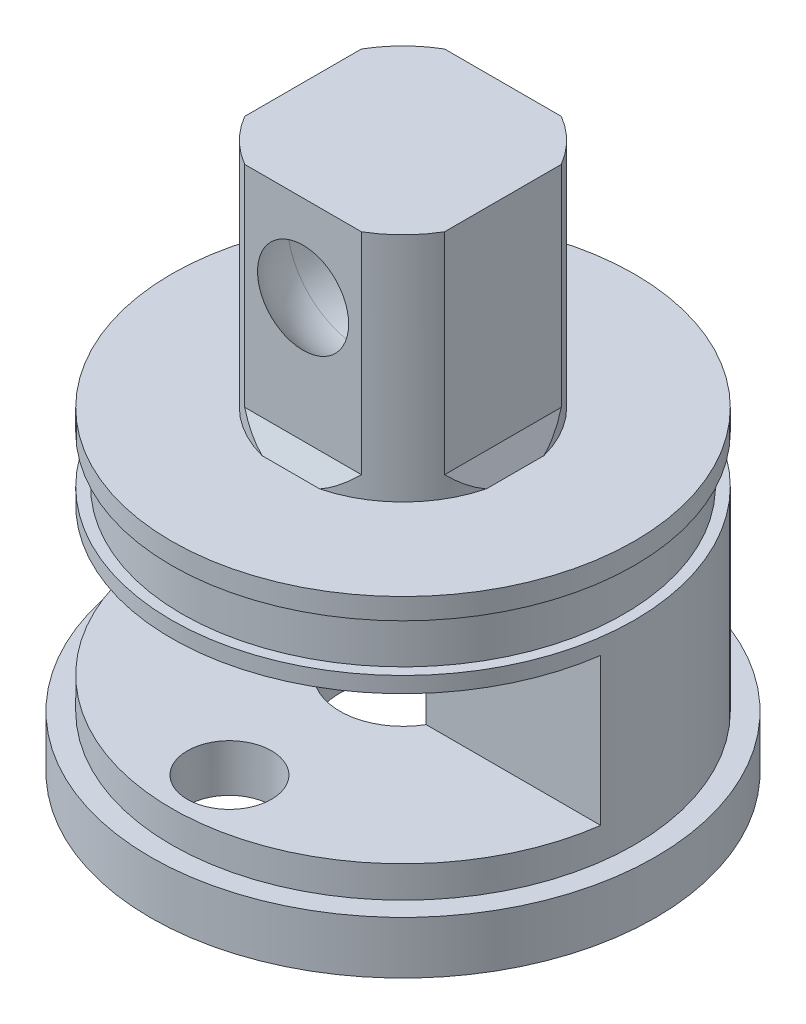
ISO-10303-21;
HEADER;
FILE_DESCRIPTION(('STEP AP214'),'2;1');
FILE_NAME('part.step','',(''),(''),'','','');
FILE_SCHEMA(('AUTOMOTIVE_DESIGN { 1 0 10303 214 1 1 1 1 }'));
ENDSEC;
DATA;
#1=APPLICATION_CONTEXT('core data for automotive mechanical design processes');
#2=APPLICATION_PROTOCOL_DEFINITION('international standard','automotive_design',2000,#1);
#3=PRODUCT_CONTEXT('',#1,'mechanical');
#4=PRODUCT('Part','Part','',(#3));
#5=PRODUCT_RELATED_PRODUCT_CATEGORY('part','',(#4));
#6=PRODUCT_DEFINITION_FORMATION('','',#4);
#7=PRODUCT_DEFINITION_CONTEXT('part definition',#1,'design');
#8=PRODUCT_DEFINITION('design','',#6,#7);
#9=PRODUCT_DEFINITION_SHAPE('','',#8);
#10=(LENGTH_UNIT() NAMED_UNIT(*) SI_UNIT(.MILLI.,.METRE.));
#11=(NAMED_UNIT(*) PLANE_ANGLE_UNIT() SI_UNIT($,.RADIAN.));
#12=(NAMED_UNIT(*) SI_UNIT($,.STERADIAN.) SOLID_ANGLE_UNIT());
#13=UNCERTAINTY_MEASURE_WITH_UNIT(LENGTH_MEASURE(1.E-05),#10,'distance_accuracy_value','');
#14=(GEOMETRIC_REPRESENTATION_CONTEXT(3) GLOBAL_UNCERTAINTY_ASSIGNED_CONTEXT((#13)) GLOBAL_UNIT_ASSIGNED_CONTEXT((#10,
#11,#12)) REPRESENTATION_CONTEXT('',''));
#15=CARTESIAN_POINT('',(0.,0.,0.));
#16=DIRECTION('',(0.,0.,1.));
#17=DIRECTION('',(1.,0.,0.));
#18=AXIS2_PLACEMENT_3D('',#15,#16,#17);
#19=CARTESIAN_POINT('',(4.75000000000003,14.25,4.75000000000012));
#20=DIRECTION('',(0.,0.,1.));
#21=DIRECTION('',(1.,0.,0.));
#22=AXIS2_PLACEMENT_3D('',#19,#20,#21);
#23=PLANE('',#22);
#24=DIRECTION('',(1.,0.,0.));
#25=VECTOR('',#24,1.);
#26=CARTESIAN_POINT('',(4.75000000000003,14.25,4.75000000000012));
#27=LINE('',#26,#25);
#28=CARTESIAN_POINT('',(-2.77263412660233,14.25,4.75000000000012));
#29=VERTEX_POINT('',#28);
#30=CARTESIAN_POINT('',(2.77263412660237,14.25,4.75000000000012));
#31=VERTEX_POINT('',#30);
#32=EDGE_CURVE('E296',#29,#31,#27,.T.);
#33=ORIENTED_EDGE('',*,*,#32,.T.);
#34=DIRECTION('',(0.,-1.,0.));
#35=VECTOR('',#34,1.);
#36=CARTESIAN_POINT('',(2.77263412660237,0.,4.75000000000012));
#37=LINE('',#36,#35);
#38=CARTESIAN_POINT('',(2.77263412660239,24.25,4.75000000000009));
#39=VERTEX_POINT('',#38);
#40=EDGE_CURVE('E273',#39,#31,#37,.T.);
#41=ORIENTED_EDGE('',*,*,#40,.F.);
#42=DIRECTION('',(1.,0.,0.));
#43=VECTOR('',#42,1.);
#44=CARTESIAN_POINT('',(5.5,24.25,4.75000000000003));
#45=LINE('',#44,#43);
#46=CARTESIAN_POINT('',(-2.77263412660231,24.25,4.75000000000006));
#47=VERTEX_POINT('',#46);
#48=EDGE_CURVE('E33',#47,#39,#45,.T.);
#49=ORIENTED_EDGE('',*,*,#48,.F.);
#50=DIRECTION('',(0.,-1.,0.));
#51=VECTOR('',#50,1.);
#52=CARTESIAN_POINT('',(-2.77263412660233,0.,4.75000000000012));
#53=LINE('',#52,#51);
#54=EDGE_CURVE('E171',#29,#47,#53,.F.);
#55=ORIENTED_EDGE('',*,*,#54,.F.);
#56=EDGE_LOOP('',(#33,#41,#49,#55));
#57=FACE_BOUND('',#56,.T.);
#58=CARTESIAN_POINT('',(0.,20.1474236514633,4.75));
#59=DIRECTION('',(0.,0.,1.));
#60=DIRECTION('',(1.,0.,0.));
#61=AXIS2_PLACEMENT_3D('',#58,#59,#60);
#62=CIRCLE('',#61,2.1650635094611);
#63=CARTESIAN_POINT('',(2.16506350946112,20.1474236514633,4.75));
#64=VERTEX_POINT('',#63);
#65=EDGE_CURVE('E330',#64,#64,#62,.F.);
#66=ORIENTED_EDGE('',*,*,#65,.T.);
#67=EDGE_LOOP('',(#66));
#68=FACE_BOUND('',#67,.T.);
#69=ADVANCED_FACE('F24',(#57,#68),#23,.T.);
#70=CARTESIAN_POINT('',(0.,0.,0.));
#71=DIRECTION('',(0.,-1.,0.));
#72=DIRECTION('',(0.,0.,-1.));
#73=AXIS2_PLACEMENT_3D('',#70,#71,#72);
#74=CYLINDRICAL_SURFACE('',#73,5.5);
#75=CARTESIAN_POINT('',(0.,13.25,1.11022302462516E-13));
#76=DIRECTION('',(0.,-1.,0.));
#77=DIRECTION('',(0.,0.,-1.));
#78=AXIS2_PLACEMENT_3D('',#75,#76,#77);
#79=CIRCLE('',#78,5.5);
#80=CARTESIAN_POINT('',(5.32735026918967,13.25,1.36723776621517));
#81=VERTEX_POINT('',#80);
#82=CARTESIAN_POINT('',(1.36723776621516,13.25,5.32735026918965));
#83=VERTEX_POINT('',#82);
#84=EDGE_CURVE('E161',#81,#83,#79,.T.);
#85=ORIENTED_EDGE('',*,*,#84,.F.);
#86=CARTESIAN_POINT('',(0.,22.4772413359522,0.));
#87=DIRECTION('',(-0.866025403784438,-0.500000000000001,0.));
#88=DIRECTION('',(0.500000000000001,-0.866025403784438,0.));
#89=AXIS2_PLACEMENT_3D('',#86,#87,#88);
#90=ELLIPSE('',#89,11.,5.5);
#91=CARTESIAN_POINT('',(4.75000000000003,14.25,2.77263412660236));
#92=VERTEX_POINT('',#91);
#93=EDGE_CURVE('E142',#81,#92,#90,.T.);
#94=ORIENTED_EDGE('',*,*,#93,.T.);
#95=DIRECTION('',(0.,-1.,0.));
#96=VECTOR('',#95,1.);
#97=CARTESIAN_POINT('',(4.75000000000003,0.,2.77263412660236));
#98=LINE('',#97,#96);
#99=CARTESIAN_POINT('',(4.75,24.25,2.77263412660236));
#100=VERTEX_POINT('',#99);
#101=EDGE_CURVE('E157',#92,#100,#98,.F.);
#102=ORIENTED_EDGE('',*,*,#101,.T.);
#103=CARTESIAN_POINT('',(0.,24.25,0.));
#104=DIRECTION('',(0.,-1.,0.));
#105=DIRECTION('',(0.,0.,-1.));
#106=AXIS2_PLACEMENT_3D('',#103,#104,#105);
#107=CIRCLE('',#106,5.5);
#108=EDGE_CURVE('E214',#100,#39,#107,.T.);
#109=ORIENTED_EDGE('',*,*,#108,.T.);
#110=ORIENTED_EDGE('',*,*,#40,.T.);
#111=CARTESIAN_POINT('',(0.,22.4772413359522,0.));
#112=DIRECTION('',(0.,-0.500000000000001,-0.866025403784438));
#113=DIRECTION('',(0.,-0.866025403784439,0.500000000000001));
#114=AXIS2_PLACEMENT_3D('',#111,#112,#113);
#115=ELLIPSE('',#114,11.,5.5);
#116=EDGE_CURVE('E162',#31,#83,#115,.T.);
#117=ORIENTED_EDGE('',*,*,#116,.T.);
#118=EDGE_LOOP('',(#85,#94,#102,#109,#110,#117));
#119=FACE_BOUND('',#118,.T.);
#120=ADVANCED_FACE('F155',(#119),#74,.T.);
#121=DIRECTION('',(0.,-1.,0.));
#122=VECTOR('',#121,1.);
#123=CARTESIAN_POINT('',(4.75000000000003,0.,-2.77263412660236));
#124=LINE('',#123,#122);
#125=CARTESIAN_POINT('',(4.75000000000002,24.25,-2.77263412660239));
#126=VERTEX_POINT('',#125);
#127=CARTESIAN_POINT('',(4.75000000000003,14.25,-2.77263412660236));
#128=VERTEX_POINT('',#127);
#129=EDGE_CURVE('E166',#126,#128,#124,.T.);
#130=ORIENTED_EDGE('',*,*,#129,.T.);
#131=CARTESIAN_POINT('',(5.32735026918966,13.25,-1.36723776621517));
#132=VERTEX_POINT('',#131);
#133=EDGE_CURVE('E145',#128,#132,#90,.T.);
#134=ORIENTED_EDGE('',*,*,#133,.T.);
#135=CARTESIAN_POINT('',(1.3672377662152,13.25,-5.32735026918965));
#136=VERTEX_POINT('',#135);
#137=EDGE_CURVE('E215',#136,#132,#79,.T.);
#138=ORIENTED_EDGE('',*,*,#137,.F.);
#139=CARTESIAN_POINT('',(0.,22.4772413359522,0.));
#140=DIRECTION('',(0.,-0.500000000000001,0.866025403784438));
#141=DIRECTION('',(0.,-0.866025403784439,-0.500000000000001));
#142=AXIS2_PLACEMENT_3D('',#139,#140,#141);
#143=ELLIPSE('',#142,11.,5.5);
#144=CARTESIAN_POINT('',(2.77263412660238,14.25,-4.74999999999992));
#145=VERTEX_POINT('',#144);
#146=EDGE_CURVE('E150',#136,#145,#143,.T.);
#147=ORIENTED_EDGE('',*,*,#146,.T.);
#148=DIRECTION('',(0.,-1.,0.));
#149=VECTOR('',#148,1.);
#150=CARTESIAN_POINT('',(2.77263412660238,0.,-4.75));
#151=LINE('',#150,#149);
#152=CARTESIAN_POINT('',(2.77263412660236,24.25,-4.75));
#153=VERTEX_POINT('',#152);
#154=EDGE_CURVE('E289',#145,#153,#151,.F.);
#155=ORIENTED_EDGE('',*,*,#154,.T.);
#156=EDGE_CURVE('E210',#153,#126,#107,.T.);
#157=ORIENTED_EDGE('',*,*,#156,.T.);
#158=EDGE_LOOP('',(#130,#134,#138,#147,#155,#157));
#159=FACE_BOUND('',#158,.T.);
#160=ADVANCED_FACE('F292',(#159),#74,.T.);
#161=CARTESIAN_POINT('',(-1.36723776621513,13.25,5.32735026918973));
#162=VERTEX_POINT('',#161);
#163=CARTESIAN_POINT('',(-5.32735026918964,13.25,1.36723776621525));
#164=VERTEX_POINT('',#163);
#165=EDGE_CURVE('E652',#162,#164,#79,.T.);
#166=ORIENTED_EDGE('',*,*,#165,.F.);
#167=EDGE_CURVE('E304',#162,#29,#115,.T.);
#168=ORIENTED_EDGE('',*,*,#167,.T.);
#169=ORIENTED_EDGE('',*,*,#54,.T.);
#170=CARTESIAN_POINT('',(-4.74999999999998,24.25,2.77263412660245));
#171=VERTEX_POINT('',#170);
#172=EDGE_CURVE('E268',#47,#171,#107,.T.);
#173=ORIENTED_EDGE('',*,*,#172,.T.);
#174=DIRECTION('',(0.,-1.,0.));
#175=VECTOR('',#174,1.);
#176=CARTESIAN_POINT('',(-4.74999999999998,0.,2.77263412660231));
#177=LINE('',#176,#175);
#178=CARTESIAN_POINT('',(-4.74999999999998,14.25,2.77263412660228));
#179=VERTEX_POINT('',#178);
#180=EDGE_CURVE('E48',#171,#179,#177,.T.);
#181=ORIENTED_EDGE('',*,*,#180,.T.);
#182=CARTESIAN_POINT('',(0.,22.4772413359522,0.));
#183=DIRECTION('',(0.866025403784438,-0.500000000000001,0.));
#184=DIRECTION('',(-0.500000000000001,-0.866025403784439,0.));
#185=AXIS2_PLACEMENT_3D('',#182,#183,#184);
#186=ELLIPSE('',#185,11.,5.5);
#187=EDGE_CURVE('E315',#179,#164,#186,.T.);
#188=ORIENTED_EDGE('',*,*,#187,.T.);
#189=EDGE_LOOP('',(#166,#168,#169,#173,#181,#188));
#190=FACE_BOUND('',#189,.T.);
#191=ADVANCED_FACE('F303',(#190),#74,.T.);
#192=CARTESIAN_POINT('',(-5.32735026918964,13.25,-1.36723776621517));
#193=VERTEX_POINT('',#192);
#194=CARTESIAN_POINT('',(-1.36723776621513,13.25,-5.32735026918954));
#195=VERTEX_POINT('',#194);
#196=EDGE_CURVE('E213',#193,#195,#79,.T.);
#197=ORIENTED_EDGE('',*,*,#196,.F.);
#198=CARTESIAN_POINT('',(-4.74999999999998,14.25,-2.77263412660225));
#199=VERTEX_POINT('',#198);
#200=EDGE_CURVE('E314',#193,#199,#186,.T.);
#201=ORIENTED_EDGE('',*,*,#200,.T.);
#202=DIRECTION('',(0.,-1.,0.));
#203=VECTOR('',#202,1.);
#204=CARTESIAN_POINT('',(-4.74999999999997,0.,-2.77263412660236));
#205=LINE('',#204,#203);
#206=CARTESIAN_POINT('',(-4.74999999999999,24.25,-2.77263412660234));
#207=VERTEX_POINT('',#206);
#208=EDGE_CURVE('E284',#199,#207,#205,.F.);
#209=ORIENTED_EDGE('',*,*,#208,.T.);
#210=CARTESIAN_POINT('',(-2.77263412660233,24.25,-4.75));
#211=VERTEX_POINT('',#210);
#212=EDGE_CURVE('E209',#207,#211,#107,.T.);
#213=ORIENTED_EDGE('',*,*,#212,.T.);
#214=DIRECTION('',(0.,-1.,0.));
#215=VECTOR('',#214,1.);
#216=CARTESIAN_POINT('',(-2.77263412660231,0.,-4.74999999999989));
#217=LINE('',#216,#215);
#218=CARTESIAN_POINT('',(-2.77263412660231,14.25,-4.74999999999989));
#219=VERTEX_POINT('',#218);
#220=EDGE_CURVE('E40',#211,#219,#217,.T.);
#221=ORIENTED_EDGE('',*,*,#220,.T.);
#222=EDGE_CURVE('E312',#219,#195,#143,.T.);
#223=ORIENTED_EDGE('',*,*,#222,.T.);
#224=EDGE_LOOP('',(#197,#201,#209,#213,#221,#223));
#225=FACE_BOUND('',#224,.T.);
#226=ADVANCED_FACE('F280',(#225),#74,.T.);
#227=CARTESIAN_POINT('',(5.50000000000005,24.25,1.11022302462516E-13));
#228=DIRECTION('',(0.,1.,0.));
#229=DIRECTION('',(0.,0.,1.));
#230=AXIS2_PLACEMENT_3D('',#227,#228,#229);
#231=PLANE('',#230);
#232=ORIENTED_EDGE('',*,*,#108,.F.);
#233=DIRECTION('',(0.,0.,-1.));
#234=VECTOR('',#233,1.);
#235=CARTESIAN_POINT('',(4.75000000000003,24.25,1.11022302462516E-13));
#236=LINE('',#235,#234);
#237=EDGE_CURVE('E11',#100,#126,#236,.T.);
#238=ORIENTED_EDGE('',*,*,#237,.T.);
#239=ORIENTED_EDGE('',*,*,#156,.F.);
#240=DIRECTION('',(-1.,0.,0.));
#241=VECTOR('',#240,1.);
#242=CARTESIAN_POINT('',(5.50000000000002,24.25,-4.74999999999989));
#243=LINE('',#242,#241);
#244=EDGE_CURVE('E257',#153,#211,#243,.T.);
#245=ORIENTED_EDGE('',*,*,#244,.T.);
#246=ORIENTED_EDGE('',*,*,#212,.F.);
#247=DIRECTION('',(0.,0.,1.));
#248=VECTOR('',#247,1.);
#249=CARTESIAN_POINT('',(-4.74999999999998,24.25,0.));
#250=LINE('',#249,#248);
#251=EDGE_CURVE('E261',#207,#171,#250,.T.);
#252=ORIENTED_EDGE('',*,*,#251,.T.);
#253=ORIENTED_EDGE('',*,*,#172,.F.);
#254=ORIENTED_EDGE('',*,*,#48,.T.);
#255=EDGE_LOOP('',(#232,#238,#239,#245,#246,#252,#253,#254));
#256=FACE_BOUND('',#255,.T.);
#257=ADVANCED_FACE('F266',(#256),#231,.T.);
#258=CARTESIAN_POINT('',(0.,0.,0.));
#259=DIRECTION('',(0.,-1.,0.));
#260=DIRECTION('',(0.,0.,-1.));
#261=AXIS2_PLACEMENT_3D('',#258,#259,#260);
#262=CYLINDRICAL_SURFACE('',#261,11.);
#263=CARTESIAN_POINT('',(0.,0.749999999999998,0.));
#264=DIRECTION('',(0.,-1.,0.));
#265=DIRECTION('',(0.,0.,-1.));
#266=AXIS2_PLACEMENT_3D('',#263,#264,#265);
#267=CIRCLE('',#266,11.);
#268=CARTESIAN_POINT('',(0.,0.749999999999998,-11.));
#269=VERTEX_POINT('',#268);
#270=EDGE_CURVE('E233',#269,#269,#267,.T.);
#271=ORIENTED_EDGE('',*,*,#270,.F.);
#272=EDGE_LOOP('',(#271));
#273=FACE_BOUND('',#272,.T.);
#274=CARTESIAN_POINT('',(0.,10.,0.));
#275=DIRECTION('',(0.,-1.,0.));
#276=DIRECTION('',(0.,0.,-1.));
#277=AXIS2_PLACEMENT_3D('',#274,#275,#276);
#278=CIRCLE('',#277,11.);
#279=CARTESIAN_POINT('',(0.,10.,-11.));
#280=VERTEX_POINT('',#279);
#281=EDGE_CURVE('E230',#280,#280,#278,.T.);
#282=ORIENTED_EDGE('',*,*,#281,.T.);
#283=EDGE_LOOP('',(#282));
#284=FACE_BOUND('',#283,.T.);
#285=CARTESIAN_POINT('',(0.,2.25,0.));
#286=DIRECTION('',(0.,1.,0.));
#287=DIRECTION('',(0.,0.,1.));
#288=AXIS2_PLACEMENT_3D('',#285,#286,#287);
#289=CIRCLE('',#288,11.);
#290=CARTESIAN_POINT('',(10.8972473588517,2.25,1.5));
#291=VERTEX_POINT('',#290);
#292=CARTESIAN_POINT('',(-10.8972473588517,2.25,1.5));
#293=VERTEX_POINT('',#292);
#294=EDGE_CURVE('E197',#291,#293,#289,.F.);
#295=ORIENTED_EDGE('',*,*,#294,.T.);
#296=DIRECTION('',(0.,-1.,0.));
#297=VECTOR('',#296,1.);
#298=CARTESIAN_POINT('',(-10.8972473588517,0.,1.5));
#299=LINE('',#298,#297);
#300=CARTESIAN_POINT('',(-10.8972473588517,9.25000000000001,1.5));
#301=VERTEX_POINT('',#300);
#302=EDGE_CURVE('E191',#293,#301,#299,.F.);
#303=ORIENTED_EDGE('',*,*,#302,.T.);
#304=CARTESIAN_POINT('',(0.,9.25,1.11022302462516E-13));
#305=DIRECTION('',(0.,-1.,0.));
#306=DIRECTION('',(0.,0.,-1.));
#307=AXIS2_PLACEMENT_3D('',#304,#305,#306);
#308=CIRCLE('',#307,11.);
#309=CARTESIAN_POINT('',(10.8972473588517,9.25000000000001,1.5));
#310=VERTEX_POINT('',#309);
#311=EDGE_CURVE('E194',#301,#310,#308,.F.);
#312=ORIENTED_EDGE('',*,*,#311,.T.);
#313=DIRECTION('',(0.,-1.,0.));
#314=VECTOR('',#313,1.);
#315=CARTESIAN_POINT('',(10.8972473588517,0.,1.50000000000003));
#316=LINE('',#315,#314);
#317=EDGE_CURVE('E188',#310,#291,#316,.T.);
#318=ORIENTED_EDGE('',*,*,#317,.T.);
#319=EDGE_LOOP('',(#295,#303,#312,#318));
#320=FACE_BOUND('',#319,.T.);
#321=ADVANCED_FACE('F396',(#273,#284,#320),#262,.T.);
#322=CARTESIAN_POINT('',(0.,0.,0.));
#323=DIRECTION('',(0.,-1.,0.));
#324=DIRECTION('',(0.,0.,-1.));
#325=AXIS2_PLACEMENT_3D('',#322,#323,#324);
#326=CYLINDRICAL_SURFACE('',#325,3.);
#327=CARTESIAN_POINT('',(0.,13.,0.));
#328=DIRECTION('',(0.,-1.,0.));
#329=DIRECTION('',(0.,0.,-1.));
#330=AXIS2_PLACEMENT_3D('',#327,#328,#329);
#331=CIRCLE('',#330,2.99999999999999);
#332=CARTESIAN_POINT('',(0.,13.,-2.99999999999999));
#333=VERTEX_POINT('',#332);
#334=EDGE_CURVE('E206',#333,#333,#331,.T.);
#335=ORIENTED_EDGE('',*,*,#334,.F.);
#336=EDGE_LOOP('',(#335));
#337=FACE_BOUND('',#336,.T.);
#338=CARTESIAN_POINT('',(0.,0.,0.));
#339=DIRECTION('',(0.,-1.,0.));
#340=DIRECTION('',(0.,0.,-1.));
#341=AXIS2_PLACEMENT_3D('',#338,#339,#340);
#342=CIRCLE('',#341,3.);
#343=CARTESIAN_POINT('',(0.,0.,-3.));
#344=VERTEX_POINT('',#343);
#345=EDGE_CURVE('E203',#344,#344,#342,.T.);
#346=ORIENTED_EDGE('',*,*,#345,.T.);
#347=EDGE_LOOP('',(#346));
#348=FACE_BOUND('',#347,.T.);
#349=CARTESIAN_POINT('',(0.,9.25,1.11022302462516E-13));
#350=DIRECTION('',(0.,-1.,0.));
#351=DIRECTION('',(0.,0.,-1.));
#352=AXIS2_PLACEMENT_3D('',#349,#350,#351);
#353=CIRCLE('',#352,3.);
#354=CARTESIAN_POINT('',(2.59807621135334,9.25000000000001,1.50000000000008));
#355=VERTEX_POINT('',#354);
#356=CARTESIAN_POINT('',(-2.59807621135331,9.25,1.5));
#357=VERTEX_POINT('',#356);
#358=EDGE_CURVE('E248',#355,#357,#353,.T.);
#359=ORIENTED_EDGE('',*,*,#358,.T.);
#360=DIRECTION('',(0.,-1.,0.));
#361=VECTOR('',#360,1.);
#362=CARTESIAN_POINT('',(-2.5980762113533,0.,1.50000000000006));
#363=LINE('',#362,#361);
#364=CARTESIAN_POINT('',(-2.5980762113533,2.25,1.50000000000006));
#365=VERTEX_POINT('',#364);
#366=EDGE_CURVE('E254',#357,#365,#363,.T.);
#367=ORIENTED_EDGE('',*,*,#366,.T.);
#368=CARTESIAN_POINT('',(0.,2.25,0.));
#369=DIRECTION('',(0.,1.,0.));
#370=DIRECTION('',(0.,0.,1.));
#371=AXIS2_PLACEMENT_3D('',#368,#369,#370);
#372=CIRCLE('',#371,3.);
#373=CARTESIAN_POINT('',(2.59807621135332,2.25,1.5));
#374=VERTEX_POINT('',#373);
#375=EDGE_CURVE('E251',#365,#374,#372,.T.);
#376=ORIENTED_EDGE('',*,*,#375,.T.);
#377=DIRECTION('',(0.,-1.,0.));
#378=VECTOR('',#377,1.);
#379=CARTESIAN_POINT('',(2.59807621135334,0.,1.50000000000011));
#380=LINE('',#379,#378);
#381=EDGE_CURVE('E245',#374,#355,#380,.F.);
#382=ORIENTED_EDGE('',*,*,#381,.T.);
#383=EDGE_LOOP('',(#359,#367,#376,#382));
#384=FACE_BOUND('',#383,.T.);
#385=ADVANCED_FACE('F393',(#337,#348,#384),#326,.F.);
#386=CARTESIAN_POINT('',(0.,0.,0.));
#387=DIRECTION('',(0.,-1.,0.));
#388=DIRECTION('',(0.,0.,-1.));
#389=AXIS2_PLACEMENT_3D('',#386,#387,#388);
#390=CYLINDRICAL_SURFACE('',#389,10.5);
#391=CARTESIAN_POINT('',(0.,-1.75,0.));
#392=DIRECTION('',(0.,-1.,0.));
#393=DIRECTION('',(0.,0.,-1.));
#394=AXIS2_PLACEMENT_3D('',#391,#392,#393);
#395=CIRCLE('',#394,10.5);
#396=CARTESIAN_POINT('',(0.,-1.75,-10.5));
#397=VERTEX_POINT('',#396);
#398=EDGE_CURVE('E242',#397,#397,#395,.T.);
#399=ORIENTED_EDGE('',*,*,#398,.T.);
#400=EDGE_LOOP('',(#399));
#401=FACE_BOUND('',#400,.T.);
#402=CARTESIAN_POINT('',(0.,0.,0.));
#403=DIRECTION('',(0.,-1.,0.));
#404=DIRECTION('',(0.,0.,-1.));
#405=AXIS2_PLACEMENT_3D('',#402,#403,#404);
#406=CIRCLE('',#405,10.5);
#407=CARTESIAN_POINT('',(0.,0.,-10.5));
#408=VERTEX_POINT('',#407);
#409=EDGE_CURVE('E200',#408,#408,#406,.T.);
#410=ORIENTED_EDGE('',*,*,#409,.F.);
#411=EDGE_LOOP('',(#410));
#412=FACE_BOUND('',#411,.T.);
#413=ADVANCED_FACE('F26',(#401,#412),#390,.F.);
#414=CARTESIAN_POINT('',(10.5,-1.75,0.));
#415=DIRECTION('',(0.,-1.,0.));
#416=DIRECTION('',(0.,0.,-1.));
#417=AXIS2_PLACEMENT_3D('',#414,#415,#416);
#418=PLANE('',#417);
#419=CARTESIAN_POINT('',(0.,-1.75,0.));
#420=DIRECTION('',(0.,-1.,0.));
#421=DIRECTION('',(0.,0.,-1.));
#422=AXIS2_PLACEMENT_3D('',#419,#420,#421);
#423=CIRCLE('',#422,12.);
#424=CARTESIAN_POINT('',(0.,-1.75,-12.));
#425=VERTEX_POINT('',#424);
#426=EDGE_CURVE('E239',#425,#425,#423,.T.);
#427=ORIENTED_EDGE('',*,*,#426,.T.);
#428=EDGE_LOOP('',(#427));
#429=FACE_BOUND('',#428,.T.);
#430=ORIENTED_EDGE('',*,*,#398,.F.);
#431=EDGE_LOOP('',(#430));
#432=FACE_BOUND('',#431,.T.);
#433=ADVANCED_FACE('F432',(#429,#432),#418,.T.);
#434=CARTESIAN_POINT('',(0.,0.,0.));
#435=DIRECTION('',(0.,-1.,0.));
#436=DIRECTION('',(0.,0.,-1.));
#437=AXIS2_PLACEMENT_3D('',#434,#435,#436);
#438=CYLINDRICAL_SURFACE('',#437,12.);
#439=CARTESIAN_POINT('',(0.,0.749999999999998,0.));
#440=DIRECTION('',(0.,-1.,0.));
#441=DIRECTION('',(0.,0.,-1.));
#442=AXIS2_PLACEMENT_3D('',#439,#440,#441);
#443=CIRCLE('',#442,12.);
#444=CARTESIAN_POINT('',(0.,0.749999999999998,-12.));
#445=VERTEX_POINT('',#444);
#446=EDGE_CURVE('E236',#445,#445,#443,.T.);
#447=ORIENTED_EDGE('',*,*,#446,.T.);
#448=EDGE_LOOP('',(#447));
#449=FACE_BOUND('',#448,.T.);
#450=ORIENTED_EDGE('',*,*,#426,.F.);
#451=EDGE_LOOP('',(#450));
#452=FACE_BOUND('',#451,.T.);
#453=ADVANCED_FACE('F429',(#449,#452),#438,.T.);
#454=CARTESIAN_POINT('',(12.,0.749999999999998,0.));
#455=DIRECTION('',(0.,1.,0.));
#456=DIRECTION('',(0.,0.,1.));
#457=AXIS2_PLACEMENT_3D('',#454,#455,#456);
#458=PLANE('',#457);
#459=ORIENTED_EDGE('',*,*,#270,.T.);
#460=EDGE_LOOP('',(#459));
#461=FACE_BOUND('',#460,.T.);
#462=ORIENTED_EDGE('',*,*,#446,.F.);
#463=EDGE_LOOP('',(#462));
#464=FACE_BOUND('',#463,.T.);
#465=ADVANCED_FACE('F422',(#461,#464),#458,.T.);
#466=CARTESIAN_POINT('',(11.,10.,0.));
#467=DIRECTION('',(0.,1.,0.));
#468=DIRECTION('',(0.,0.,1.));
#469=AXIS2_PLACEMENT_3D('',#466,#467,#468);
#470=PLANE('',#469);
#471=CARTESIAN_POINT('',(0.,10.,0.));
#472=DIRECTION('',(0.,-1.,0.));
#473=DIRECTION('',(0.,0.,-1.));
#474=AXIS2_PLACEMENT_3D('',#471,#472,#473);
#475=CIRCLE('',#474,10.5);
#476=CARTESIAN_POINT('',(0.,10.,-10.5));
#477=VERTEX_POINT('',#476);
#478=EDGE_CURVE('E227',#477,#477,#475,.T.);
#479=ORIENTED_EDGE('',*,*,#478,.T.);
#480=EDGE_LOOP('',(#479));
#481=FACE_BOUND('',#480,.T.);
#482=ORIENTED_EDGE('',*,*,#281,.F.);
#483=EDGE_LOOP('',(#482));
#484=FACE_BOUND('',#483,.T.);
#485=ADVANCED_FACE('F418',(#481,#484),#470,.T.);
#486=CARTESIAN_POINT('',(0.,0.,0.));
#487=DIRECTION('',(0.,-1.,0.));
#488=DIRECTION('',(0.,0.,-1.));
#489=AXIS2_PLACEMENT_3D('',#486,#487,#488);
#490=CYLINDRICAL_SURFACE('',#489,10.5);
#491=CARTESIAN_POINT('',(0.,12.25,1.11022302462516E-13));
#492=DIRECTION('',(0.,-1.,0.));
#493=DIRECTION('',(0.,0.,-1.));
#494=AXIS2_PLACEMENT_3D('',#491,#492,#493);
#495=CIRCLE('',#494,10.5);
#496=CARTESIAN_POINT('',(0.,12.25,-10.4999999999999));
#497=VERTEX_POINT('',#496);
#498=EDGE_CURVE('E224',#497,#497,#495,.T.);
#499=ORIENTED_EDGE('',*,*,#498,.T.);
#500=EDGE_LOOP('',(#499));
#501=FACE_BOUND('',#500,.T.);
#502=ORIENTED_EDGE('',*,*,#478,.F.);
#503=EDGE_LOOP('',(#502));
#504=FACE_BOUND('',#503,.T.);
#505=ADVANCED_FACE('F414',(#501,#504),#490,.T.);
#506=CARTESIAN_POINT('',(10.5,12.25,0.));
#507=DIRECTION('',(0.,-1.,0.));
#508=DIRECTION('',(0.,0.,-1.));
#509=AXIS2_PLACEMENT_3D('',#506,#507,#508);
#510=PLANE('',#509);
#511=CARTESIAN_POINT('',(0.,12.25,1.11022302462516E-13));
#512=DIRECTION('',(0.,-1.,0.));
#513=DIRECTION('',(0.,0.,-1.));
#514=AXIS2_PLACEMENT_3D('',#511,#512,#513);
#515=CIRCLE('',#514,11.);
#516=CARTESIAN_POINT('',(0.,12.25,-10.9999999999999));
#517=VERTEX_POINT('',#516);
#518=EDGE_CURVE('E221',#517,#517,#515,.T.);
#519=ORIENTED_EDGE('',*,*,#518,.T.);
#520=EDGE_LOOP('',(#519));
#521=FACE_BOUND('',#520,.T.);
#522=ORIENTED_EDGE('',*,*,#498,.F.);
#523=EDGE_LOOP('',(#522));
#524=FACE_BOUND('',#523,.T.);
#525=ADVANCED_FACE('F410',(#521,#524),#510,.T.);
#526=CARTESIAN_POINT('',(0.,0.,0.));
#527=DIRECTION('',(0.,-1.,0.));
#528=DIRECTION('',(0.,0.,-1.));
#529=AXIS2_PLACEMENT_3D('',#526,#527,#528);
#530=CYLINDRICAL_SURFACE('',#529,11.);
#531=CARTESIAN_POINT('',(0.,13.25,1.11022302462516E-13));
#532=DIRECTION('',(0.,-1.,0.));
#533=DIRECTION('',(0.,0.,-1.));
#534=AXIS2_PLACEMENT_3D('',#531,#532,#533);
#535=CIRCLE('',#534,11.);
#536=CARTESIAN_POINT('',(0.,13.25,-10.9999999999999));
#537=VERTEX_POINT('',#536);
#538=EDGE_CURVE('E218',#537,#537,#535,.T.);
#539=ORIENTED_EDGE('',*,*,#538,.T.);
#540=EDGE_LOOP('',(#539));
#541=FACE_BOUND('',#540,.T.);
#542=ORIENTED_EDGE('',*,*,#518,.F.);
#543=EDGE_LOOP('',(#542));
#544=FACE_BOUND('',#543,.T.);
#545=ADVANCED_FACE('F406',(#541,#544),#530,.T.);
#546=CARTESIAN_POINT('',(11.,13.25,0.));
#547=DIRECTION('',(0.,1.,0.));
#548=DIRECTION('',(0.,0.,1.));
#549=AXIS2_PLACEMENT_3D('',#546,#547,#548);
#550=PLANE('',#549);
#551=ORIENTED_EDGE('',*,*,#538,.F.);
#552=EDGE_LOOP('',(#551));
#553=FACE_BOUND('',#552,.T.);
#554=ORIENTED_EDGE('',*,*,#137,.T.);
#555=DIRECTION('',(0.,0.,1.));
#556=VECTOR('',#555,1.);
#557=CARTESIAN_POINT('',(5.32735026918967,13.25,-4.75));
#558=LINE('',#557,#556);
#559=EDGE_CURVE('E320',#81,#132,#558,.F.);
#560=ORIENTED_EDGE('',*,*,#559,.F.);
#561=ORIENTED_EDGE('',*,*,#84,.T.);
#562=DIRECTION('',(-1.,0.,0.));
#563=VECTOR('',#562,1.);
#564=CARTESIAN_POINT('',(4.75000000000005,13.25,5.32735026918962));
#565=LINE('',#564,#563);
#566=EDGE_CURVE('E319',#162,#83,#565,.F.);
#567=ORIENTED_EDGE('',*,*,#566,.F.);
#568=ORIENTED_EDGE('',*,*,#165,.T.);
#569=DIRECTION('',(0.,0.,-1.));
#570=VECTOR('',#569,1.);
#571=CARTESIAN_POINT('',(-5.32735026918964,13.25,-4.75000000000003));
#572=LINE('',#571,#570);
#573=EDGE_CURVE('E325',#193,#164,#572,.F.);
#574=ORIENTED_EDGE('',*,*,#573,.F.);
#575=ORIENTED_EDGE('',*,*,#196,.T.);
#576=DIRECTION('',(1.,0.,0.));
#577=VECTOR('',#576,1.);
#578=CARTESIAN_POINT('',(4.75000000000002,13.25,-5.32735026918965));
#579=LINE('',#578,#577);
#580=EDGE_CURVE('E322',#136,#195,#579,.F.);
#581=ORIENTED_EDGE('',*,*,#580,.F.);
#582=EDGE_LOOP('',(#554,#560,#561,#567,#568,#574,#575,#581));
#583=FACE_BOUND('',#582,.T.);
#584=ADVANCED_FACE('F400',(#553,#583),#550,.T.);
#585=CARTESIAN_POINT('',(0.,13.,0.));
#586=DIRECTION('',(0.,-1.,0.));
#587=DIRECTION('',(0.,0.,-1.));
#588=AXIS2_PLACEMENT_3D('',#585,#586,#587);
#589=PLANE('',#588);
#590=ORIENTED_EDGE('',*,*,#334,.T.);
#591=EDGE_LOOP('',(#590));
#592=FACE_BOUND('',#591,.T.);
#593=ADVANCED_FACE('F391',(#592),#589,.T.);
#594=CARTESIAN_POINT('',(3.00000000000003,0.,0.));
#595=DIRECTION('',(0.,-1.,0.));
#596=DIRECTION('',(0.,0.,-1.));
#597=AXIS2_PLACEMENT_3D('',#594,#595,#596);
#598=PLANE('',#597);
#599=CARTESIAN_POINT('',(0.,0.,8.24999999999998));
#600=DIRECTION('',(0.,-1.,0.));
#601=DIRECTION('',(0.,0.,-1.));
#602=AXIS2_PLACEMENT_3D('',#599,#600,#601);
#603=CIRCLE('',#602,2.);
#604=CARTESIAN_POINT('',(0.,0.,6.24999999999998));
#605=VERTEX_POINT('',#604);
#606=EDGE_CURVE('E165',#605,#605,#603,.T.);
#607=ORIENTED_EDGE('',*,*,#606,.F.);
#608=EDGE_LOOP('',(#607));
#609=FACE_BOUND('',#608,.T.);
#610=ORIENTED_EDGE('',*,*,#409,.T.);
#611=EDGE_LOOP('',(#610));
#612=FACE_BOUND('',#611,.T.);
#613=ORIENTED_EDGE('',*,*,#345,.F.);
#614=EDGE_LOOP('',(#613));
#615=FACE_BOUND('',#614,.T.);
#616=ADVANCED_FACE('F388',(#609,#612,#615),#598,.T.);
#617=CARTESIAN_POINT('',(-14.2361160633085,2.25,1.5));
#618=DIRECTION('',(0.,0.,1.));
#619=DIRECTION('',(1.,0.,0.));
#620=AXIS2_PLACEMENT_3D('',#617,#618,#619);
#621=PLANE('',#620);
#622=DIRECTION('',(1.,0.,0.));
#623=VECTOR('',#622,1.);
#624=CARTESIAN_POINT('',(-14.2361160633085,2.25,1.5));
#625=LINE('',#624,#623);
#626=EDGE_CURVE('E183',#293,#365,#625,.T.);
#627=ORIENTED_EDGE('',*,*,#626,.T.);
#628=ORIENTED_EDGE('',*,*,#366,.F.);
#629=DIRECTION('',(-1.,0.,0.));
#630=VECTOR('',#629,1.);
#631=CARTESIAN_POINT('',(-14.2361160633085,9.25,1.50000000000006));
#632=LINE('',#631,#630);
#633=EDGE_CURVE('E184',#357,#301,#632,.T.);
#634=ORIENTED_EDGE('',*,*,#633,.T.);
#635=ORIENTED_EDGE('',*,*,#302,.F.);
#636=EDGE_LOOP('',(#627,#628,#634,#635));
#637=FACE_BOUND('',#636,.T.);
#638=ADVANCED_FACE('F380',(#637),#621,.T.);
#639=CARTESIAN_POINT('',(-14.2361160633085,2.25,11.5));
#640=DIRECTION('',(0.,1.,0.));
#641=DIRECTION('',(0.,0.,1.));
#642=AXIS2_PLACEMENT_3D('',#639,#640,#641);
#643=PLANE('',#642);
#644=CARTESIAN_POINT('',(0.,2.25,8.25000000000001));
#645=DIRECTION('',(0.,1.,0.));
#646=DIRECTION('',(0.,0.,1.));
#647=AXIS2_PLACEMENT_3D('',#644,#645,#646);
#648=CIRCLE('',#647,2.);
#649=CARTESIAN_POINT('',(0.,2.25,10.25));
#650=VERTEX_POINT('',#649);
#651=EDGE_CURVE('E178',#650,#650,#648,.T.);
#652=ORIENTED_EDGE('',*,*,#651,.F.);
#653=EDGE_LOOP('',(#652));
#654=FACE_BOUND('',#653,.T.);
#655=EDGE_CURVE('E181',#374,#291,#625,.T.);
#656=ORIENTED_EDGE('',*,*,#655,.F.);
#657=ORIENTED_EDGE('',*,*,#375,.F.);
#658=ORIENTED_EDGE('',*,*,#626,.F.);
#659=ORIENTED_EDGE('',*,*,#294,.F.);
#660=EDGE_LOOP('',(#656,#657,#658,#659));
#661=FACE_BOUND('',#660,.T.);
#662=ADVANCED_FACE('F383',(#654,#661),#643,.T.);
#663=CARTESIAN_POINT('',(-14.2361160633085,9.25000000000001,11.5000000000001));
#664=DIRECTION('',(0.,-1.,0.));
#665=DIRECTION('',(0.,0.,-1.));
#666=AXIS2_PLACEMENT_3D('',#663,#664,#665);
#667=PLANE('',#666);
#668=CARTESIAN_POINT('',(0.,9.25000000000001,8.25000000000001));
#669=DIRECTION('',(0.,-1.,0.));
#670=DIRECTION('',(0.,0.,-1.));
#671=AXIS2_PLACEMENT_3D('',#668,#669,#670);
#672=CIRCLE('',#671,2.);
#673=CARTESIAN_POINT('',(0.,9.25000000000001,6.25000000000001));
#674=VERTEX_POINT('',#673);
#675=EDGE_CURVE('E177',#674,#674,#672,.T.);
#676=ORIENTED_EDGE('',*,*,#675,.F.);
#677=EDGE_LOOP('',(#676));
#678=FACE_BOUND('',#677,.T.);
#679=ORIENTED_EDGE('',*,*,#633,.F.);
#680=ORIENTED_EDGE('',*,*,#358,.F.);
#681=EDGE_CURVE('E187',#310,#355,#632,.T.);
#682=ORIENTED_EDGE('',*,*,#681,.F.);
#683=ORIENTED_EDGE('',*,*,#311,.F.);
#684=EDGE_LOOP('',(#679,#680,#682,#683));
#685=FACE_BOUND('',#684,.T.);
#686=ADVANCED_FACE('F378',(#678,#685),#667,.T.);
#687=ORIENTED_EDGE('',*,*,#681,.T.);
#688=ORIENTED_EDGE('',*,*,#381,.F.);
#689=ORIENTED_EDGE('',*,*,#655,.T.);
#690=ORIENTED_EDGE('',*,*,#317,.F.);
#691=EDGE_LOOP('',(#687,#688,#689,#690));
#692=FACE_BOUND('',#691,.T.);
#693=ADVANCED_FACE('F371',(#692),#621,.T.);
#694=CARTESIAN_POINT('',(0.,11.,8.25000000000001));
#695=DIRECTION('',(0.,-1.,0.));
#696=DIRECTION('',(0.,0.,-1.));
#697=AXIS2_PLACEMENT_3D('',#694,#695,#696);
#698=PLANE('',#697);
#699=CARTESIAN_POINT('',(0.,11.,8.25000000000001));
#700=DIRECTION('',(0.,-1.,0.));
#701=DIRECTION('',(0.,0.,-1.));
#702=AXIS2_PLACEMENT_3D('',#699,#700,#701);
#703=CIRCLE('',#702,2.);
#704=CARTESIAN_POINT('',(0.,11.,6.25000000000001));
#705=VERTEX_POINT('',#704);
#706=EDGE_CURVE('E169',#705,#705,#703,.T.);
#707=ORIENTED_EDGE('',*,*,#706,.T.);
#708=EDGE_LOOP('',(#707));
#709=FACE_BOUND('',#708,.T.);
#710=ADVANCED_FACE('F367',(#709),#698,.T.);
#711=CARTESIAN_POINT('',(0.,11.,8.25000000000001));
#712=DIRECTION('',(0.,-1.,0.));
#713=DIRECTION('',(0.,0.,-1.));
#714=AXIS2_PLACEMENT_3D('',#711,#712,#713);
#715=CYLINDRICAL_SURFACE('',#714,2.);
#716=ORIENTED_EDGE('',*,*,#675,.T.);
#717=EDGE_LOOP('',(#716));
#718=FACE_BOUND('',#717,.T.);
#719=ORIENTED_EDGE('',*,*,#706,.F.);
#720=EDGE_LOOP('',(#719));
#721=FACE_BOUND('',#720,.T.);
#722=ADVANCED_FACE('F370',(#718,#721),#715,.F.);
#723=ORIENTED_EDGE('',*,*,#651,.T.);
#724=EDGE_LOOP('',(#723));
#725=FACE_BOUND('',#724,.T.);
#726=ORIENTED_EDGE('',*,*,#606,.T.);
#727=EDGE_LOOP('',(#726));
#728=FACE_BOUND('',#727,.T.);
#729=ADVANCED_FACE('F364',(#725,#728),#715,.F.);
#730=CARTESIAN_POINT('',(4.75,14.25,-4.74999999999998));
#731=DIRECTION('',(0.,0.,-1.));
#732=DIRECTION('',(-1.,0.,0.));
#733=AXIS2_PLACEMENT_3D('',#730,#731,#732);
#734=PLANE('',#733);
#735=DIRECTION('',(-1.,0.,0.));
#736=VECTOR('',#735,1.);
#737=CARTESIAN_POINT('',(4.75,14.25,-4.74999999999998));
#738=LINE('',#737,#736);
#739=EDGE_CURVE('E149',#145,#219,#738,.T.);
#740=ORIENTED_EDGE('',*,*,#739,.T.);
#741=ORIENTED_EDGE('',*,*,#220,.F.);
#742=ORIENTED_EDGE('',*,*,#244,.F.);
#743=ORIENTED_EDGE('',*,*,#154,.F.);
#744=EDGE_LOOP('',(#740,#741,#742,#743));
#745=FACE_BOUND('',#744,.T.);
#746=ADVANCED_FACE('F288',(#745),#734,.T.);
#747=CARTESIAN_POINT('',(-4.74999999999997,14.25,-4.74999999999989));
#748=DIRECTION('',(-1.,0.,0.));
#749=DIRECTION('',(0.,0.,1.));
#750=AXIS2_PLACEMENT_3D('',#747,#748,#749);
#751=PLANE('',#750);
#752=DIRECTION('',(0.,0.,1.));
#753=VECTOR('',#752,1.);
#754=CARTESIAN_POINT('',(-4.74999999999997,14.25,-4.74999999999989));
#755=LINE('',#754,#753);
#756=EDGE_CURVE('E308',#199,#179,#755,.T.);
#757=ORIENTED_EDGE('',*,*,#756,.T.);
#758=ORIENTED_EDGE('',*,*,#180,.F.);
#759=ORIENTED_EDGE('',*,*,#251,.F.);
#760=ORIENTED_EDGE('',*,*,#208,.F.);
#761=EDGE_LOOP('',(#757,#758,#759,#760));
#762=FACE_BOUND('',#761,.T.);
#763=ADVANCED_FACE('F359',(#762),#751,.T.);
#764=CARTESIAN_POINT('',(4.75,14.25,-4.74999999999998));
#765=DIRECTION('',(1.,0.,0.));
#766=DIRECTION('',(0.,0.,-1.));
#767=AXIS2_PLACEMENT_3D('',#764,#765,#766);
#768=PLANE('',#767);
#769=DIRECTION('',(0.,0.,-1.));
#770=VECTOR('',#769,1.);
#771=CARTESIAN_POINT('',(4.75,14.25,-4.74999999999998));
#772=LINE('',#771,#770);
#773=EDGE_CURVE('E139',#92,#128,#772,.T.);
#774=ORIENTED_EDGE('',*,*,#773,.T.);
#775=ORIENTED_EDGE('',*,*,#129,.F.);
#776=ORIENTED_EDGE('',*,*,#237,.F.);
#777=ORIENTED_EDGE('',*,*,#101,.F.);
#778=EDGE_LOOP('',(#774,#775,#776,#777));
#779=FACE_BOUND('',#778,.T.);
#780=ADVANCED_FACE('F164',(#779),#768,.T.);
#781=CARTESIAN_POINT('',(4.75000000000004,14.25,-4.74999999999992));
#782=DIRECTION('',(-0.866025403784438,-0.500000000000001,0.));
#783=DIRECTION('',(0.500000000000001,-0.866025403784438,0.));
#784=AXIS2_PLACEMENT_3D('',#781,#782,#783);
#785=PLANE('',#784);
#786=ORIENTED_EDGE('',*,*,#559,.T.);
#787=ORIENTED_EDGE('',*,*,#133,.F.);
#788=ORIENTED_EDGE('',*,*,#773,.F.);
#789=ORIENTED_EDGE('',*,*,#93,.F.);
#790=EDGE_LOOP('',(#786,#787,#788,#789));
#791=FACE_BOUND('',#790,.T.);
#792=ADVANCED_FACE('F141',(#791),#785,.F.);
#793=CARTESIAN_POINT('',(4.75000000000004,14.25,4.75000000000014));
#794=DIRECTION('',(0.,-0.500000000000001,-0.866025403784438));
#795=DIRECTION('',(0.,0.866025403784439,-0.500000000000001));
#796=AXIS2_PLACEMENT_3D('',#793,#794,#795);
#797=PLANE('',#796);
#798=ORIENTED_EDGE('',*,*,#566,.T.);
#799=ORIENTED_EDGE('',*,*,#116,.F.);
#800=ORIENTED_EDGE('',*,*,#32,.F.);
#801=ORIENTED_EDGE('',*,*,#167,.F.);
#802=EDGE_LOOP('',(#798,#799,#800,#801));
#803=FACE_BOUND('',#802,.T.);
#804=ADVANCED_FACE('F513',(#803),#797,.F.);
#805=CARTESIAN_POINT('',(-4.74999999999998,14.25,-4.74999999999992));
#806=DIRECTION('',(0.866025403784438,-0.500000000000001,0.));
#807=DIRECTION('',(0.500000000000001,0.866025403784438,0.));
#808=AXIS2_PLACEMENT_3D('',#805,#806,#807);
#809=PLANE('',#808);
#810=ORIENTED_EDGE('',*,*,#573,.T.);
#811=ORIENTED_EDGE('',*,*,#187,.F.);
#812=ORIENTED_EDGE('',*,*,#756,.F.);
#813=ORIENTED_EDGE('',*,*,#200,.F.);
#814=EDGE_LOOP('',(#810,#811,#812,#813));
#815=FACE_BOUND('',#814,.T.);
#816=ADVANCED_FACE('F357',(#815),#809,.F.);
#817=CARTESIAN_POINT('',(4.75000000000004,14.25,-4.74999999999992));
#818=DIRECTION('',(0.,-0.500000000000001,0.866025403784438));
#819=DIRECTION('',(0.,-0.866025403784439,-0.500000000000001));
#820=AXIS2_PLACEMENT_3D('',#817,#818,#819);
#821=PLANE('',#820);
#822=ORIENTED_EDGE('',*,*,#580,.T.);
#823=ORIENTED_EDGE('',*,*,#222,.F.);
#824=ORIENTED_EDGE('',*,*,#739,.F.);
#825=ORIENTED_EDGE('',*,*,#146,.F.);
#826=EDGE_LOOP('',(#822,#823,#824,#825));
#827=FACE_BOUND('',#826,.T.);
#828=ADVANCED_FACE('F346',(#827),#821,.F.);
#829=CARTESIAN_POINT('',(0.,20.1474236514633,2.));
#830=DIRECTION('',(0.,1.,0.));
#831=DIRECTION('',(1.,0.,0.));
#832=AXIS2_PLACEMENT_3D('',#829,#830,#831);
#833=SPHERICAL_SURFACE('',#832,3.5);
#834=CARTESIAN_POINT('',(0.,20.1474236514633,2.));
#835=DIRECTION('',(0.,0.,1.));
#836=DIRECTION('',(1.,0.,0.));
#837=AXIS2_PLACEMENT_3D('',#834,#835,#836);
#838=SPHERICAL_SURFACE('',#837,3.5);
#839=CARTESIAN_POINT('',(0.,20.1474236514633,2.));
#840=DIRECTION('',(0.,0.,1.));
#841=DIRECTION('',(1.,0.,0.));
#842=AXIS2_PLACEMENT_3D('',#839,#840,#841);
#843=CIRCLE('',#842,3.5);
#844=CARTESIAN_POINT('',(3.50000000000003,20.1474236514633,2.));
#845=VERTEX_POINT('',#844);
#846=EDGE_CURVE('E336',#845,#845,#843,.T.);
#847=ORIENTED_EDGE('',*,*,#846,.F.);
#848=EDGE_LOOP('',(#847));
#849=FACE_BOUND('',#848,.T.);
#850=ORIENTED_EDGE('',*,*,#65,.F.);
#851=EDGE_LOOP('',(#850));
#852=FACE_BOUND('',#851,.T.);
#853=ADVANCED_FACE('F342',(#849,#852),#838,.F.);
#854=CARTESIAN_POINT('',(0.,20.1474236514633,-1.));
#855=DIRECTION('',(0.,0.,1.));
#856=DIRECTION('',(1.,0.,0.));
#857=AXIS2_PLACEMENT_3D('',#854,#855,#856);
#858=PLANE('',#857);
#859=CARTESIAN_POINT('',(0.,20.1474236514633,-1.));
#860=DIRECTION('',(0.,0.,1.));
#861=DIRECTION('',(1.,0.,0.));
#862=AXIS2_PLACEMENT_3D('',#859,#860,#861);
#863=CIRCLE('',#862,3.5);
#864=CARTESIAN_POINT('',(3.50000000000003,20.1474236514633,-1.));
#865=VERTEX_POINT('',#864);
#866=EDGE_CURVE('E333',#865,#865,#863,.T.);
#867=ORIENTED_EDGE('',*,*,#866,.T.);
#868=EDGE_LOOP('',(#867));
#869=FACE_BOUND('',#868,.T.);
#870=CARTESIAN_POINT('',(0.,20.1474236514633,-1.));
#871=DIRECTION('',(0.,0.,1.));
#872=DIRECTION('',(1.,0.,0.));
#873=AXIS2_PLACEMENT_3D('',#870,#871,#872);
#874=CIRCLE('',#873,2.);
#875=CARTESIAN_POINT('',(2.00000000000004,20.1474236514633,-1.));
#876=VERTEX_POINT('',#875);
#877=EDGE_CURVE('E28',#876,#876,#874,.F.);
#878=ORIENTED_EDGE('',*,*,#877,.T.);
#879=EDGE_LOOP('',(#878));
#880=FACE_BOUND('',#879,.T.);
#881=ADVANCED_FACE('F345',(#869,#880),#858,.T.);
#882=CARTESIAN_POINT('',(0.,20.1474236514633,-1.));
#883=DIRECTION('',(0.,0.,1.));
#884=DIRECTION('',(1.,0.,0.));
#885=AXIS2_PLACEMENT_3D('',#882,#883,#884);
#886=CYLINDRICAL_SURFACE('',#885,3.5);
#887=ORIENTED_EDGE('',*,*,#866,.F.);
#888=EDGE_LOOP('',(#887));
#889=FACE_BOUND('',#888,.T.);
#890=ORIENTED_EDGE('',*,*,#846,.T.);
#891=EDGE_LOOP('',(#890));
#892=FACE_BOUND('',#891,.T.);
#893=ADVANCED_FACE('F340',(#889,#892),#886,.F.);
#894=CARTESIAN_POINT('',(0.,20.1474236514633,-3.74999999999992));
#895=DIRECTION('',(0.,0.,1.));
#896=DIRECTION('',(1.,0.,0.));
#897=AXIS2_PLACEMENT_3D('',#894,#895,#896);
#898=PLANE('',#897);
#899=CARTESIAN_POINT('',(0.,20.1474236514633,-3.74999999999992));
#900=DIRECTION('',(0.,0.,1.));
#901=DIRECTION('',(1.,0.,0.));
#902=AXIS2_PLACEMENT_3D('',#899,#900,#901);
#903=CIRCLE('',#902,2.);
#904=CARTESIAN_POINT('',(2.00000000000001,20.1474236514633,-3.74999999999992));
#905=VERTEX_POINT('',#904);
#906=EDGE_CURVE('E323',#905,#905,#903,.T.);
#907=ORIENTED_EDGE('',*,*,#906,.T.);
#908=EDGE_LOOP('',(#907));
#909=FACE_BOUND('',#908,.T.);
#910=ADVANCED_FACE('F551',(#909),#898,.T.);
#911=CARTESIAN_POINT('',(0.,20.1474236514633,-3.74999999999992));
#912=DIRECTION('',(0.,0.,1.));
#913=DIRECTION('',(1.,0.,0.));
#914=AXIS2_PLACEMENT_3D('',#911,#912,#913);
#915=CYLINDRICAL_SURFACE('',#914,2.);
#916=ORIENTED_EDGE('',*,*,#906,.F.);
#917=EDGE_LOOP('',(#916));
#918=FACE_BOUND('',#917,.T.);
#919=ORIENTED_EDGE('',*,*,#877,.F.);
#920=EDGE_LOOP('',(#919));
#921=FACE_BOUND('',#920,.T.);
#922=ADVANCED_FACE('F558',(#918,#921),#915,.F.);
#923=CLOSED_SHELL('',(#69,#120,#160,#191,#226,#257,#321,#385,#413,#433,#453,#465,#485,#505,#525,
#545,#584,#593,#616,#638,#662,#686,#693,#710,#722,#729,#746,#763,#780,#792,#804,#816,#828,#853,
#881,#893,#910,#922));
#924=MANIFOLD_SOLID_BREP('B2',#923);
#925=ADVANCED_BREP_SHAPE_REPRESENTATION('',(#18,#924),#14);
#926=SHAPE_DEFINITION_REPRESENTATION(#9,#925);
ENDSEC;
END-ISO-10303-21;
